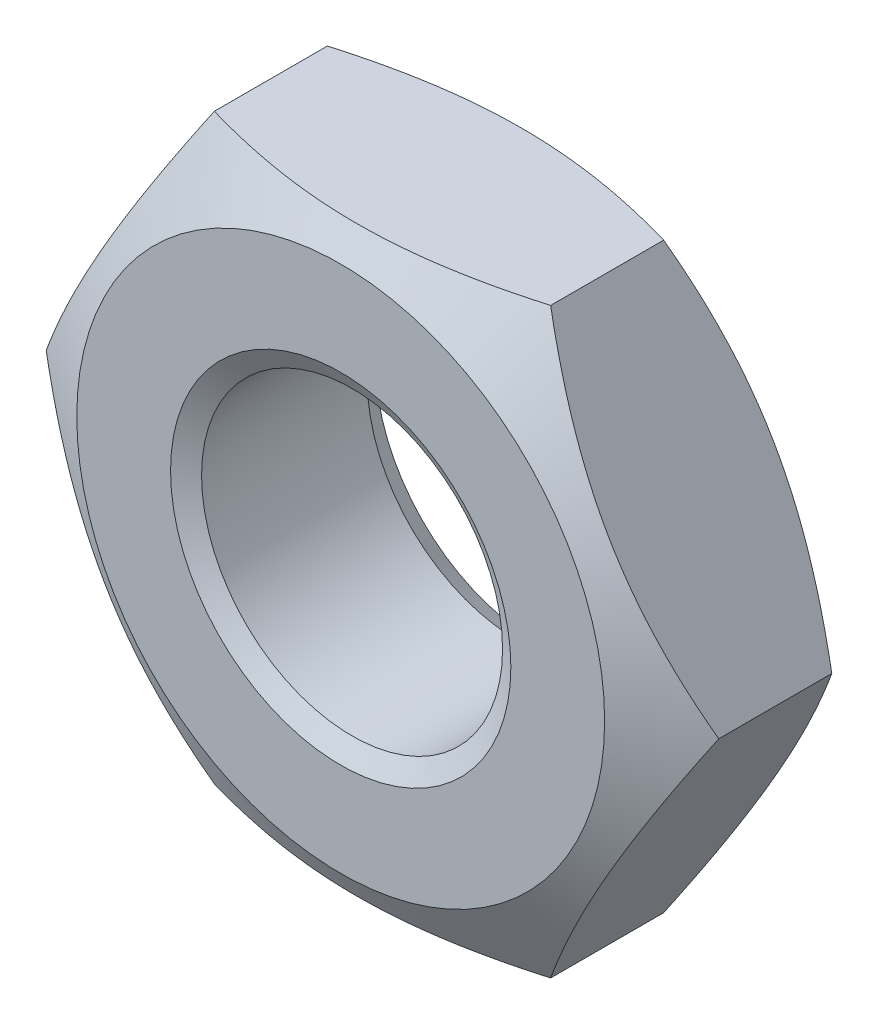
ISO-10303-21;
HEADER;
FILE_DESCRIPTION(('STEP AP214'),'2;1');
FILE_NAME('part.step','',(''),(''),'','','');
FILE_SCHEMA(('AUTOMOTIVE_DESIGN { 1 0 10303 214 1 1 1 1 }'));
ENDSEC;
DATA;
#1=APPLICATION_CONTEXT('core data for automotive mechanical design processes');
#2=APPLICATION_PROTOCOL_DEFINITION('international standard','automotive_design',2000,#1);
#3=PRODUCT_CONTEXT('',#1,'mechanical');
#4=PRODUCT('Part','Part','',(#3));
#5=PRODUCT_RELATED_PRODUCT_CATEGORY('part','',(#4));
#6=PRODUCT_DEFINITION_FORMATION('','',#4);
#7=PRODUCT_DEFINITION_CONTEXT('part definition',#1,'design');
#8=PRODUCT_DEFINITION('design','',#6,#7);
#9=PRODUCT_DEFINITION_SHAPE('','',#8);
#10=(LENGTH_UNIT() NAMED_UNIT(*) SI_UNIT(.MILLI.,.METRE.));
#11=(NAMED_UNIT(*) PLANE_ANGLE_UNIT() SI_UNIT($,.RADIAN.));
#12=(NAMED_UNIT(*) SI_UNIT($,.STERADIAN.) SOLID_ANGLE_UNIT());
#13=UNCERTAINTY_MEASURE_WITH_UNIT(LENGTH_MEASURE(1.E-05),#10,'distance_accuracy_value','');
#14=(GEOMETRIC_REPRESENTATION_CONTEXT(3) GLOBAL_UNCERTAINTY_ASSIGNED_CONTEXT((#13)) GLOBAL_UNIT_ASSIGNED_CONTEXT((#10,
#11,#12)) REPRESENTATION_CONTEXT('',''));
#15=CARTESIAN_POINT('',(0.,0.,0.));
#16=DIRECTION('',(0.,0.,1.));
#17=DIRECTION('',(1.,0.,0.));
#18=AXIS2_PLACEMENT_3D('',#15,#16,#17);
#19=CARTESIAN_POINT('',(-2.3094010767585,-4.,0.));
#20=DIRECTION('',(0.,0.,-1.));
#21=DIRECTION('',(-1.,0.,0.));
#22=AXIS2_PLACEMENT_3D('',#19,#20,#21);
#23=PLANE('',#22);
#24=CARTESIAN_POINT('',(0.,0.,0.));
#25=DIRECTION('',(0.,0.,-1.));
#26=DIRECTION('',(-1.,0.,0.));
#27=AXIS2_PLACEMENT_3D('',#24,#25,#26);
#28=CIRCLE('',#27,3.62499999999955);
#29=CARTESIAN_POINT('',(-3.62499999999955,0.,0.));
#30=VERTEX_POINT('',#29);
#31=EDGE_CURVE('E136',#30,#30,#28,.T.);
#32=ORIENTED_EDGE('',*,*,#31,.F.);
#33=EDGE_LOOP('',(#32));
#34=FACE_BOUND('',#33,.T.);
#35=CARTESIAN_POINT('',(0.,0.,8.79370749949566E-12));
#36=DIRECTION('',(0.,0.,1.));
#37=DIRECTION('',(1.,0.,0.));
#38=AXIS2_PLACEMENT_3D('',#35,#36,#37);
#39=CIRCLE('',#38,2.33699999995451);
#40=CARTESIAN_POINT('',(2.33699999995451,0.,8.79370749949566E-12));
#41=VERTEX_POINT('',#40);
#42=EDGE_CURVE('E20',#41,#41,#39,.F.);
#43=ORIENTED_EDGE('',*,*,#42,.T.);
#44=EDGE_LOOP('',(#43));
#45=FACE_BOUND('',#44,.T.);
#46=ADVANCED_FACE('F17',(#34,#45),#23,.F.);
#47=CARTESIAN_POINT('',(0.,0.,-5.6843418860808E-11));
#48=DIRECTION('',(0.,0.,1.));
#49=DIRECTION('',(1.,0.,0.));
#50=AXIS2_PLACEMENT_3D('',#47,#48,#49);
#51=CONICAL_SURFACE('',#50,2.33699999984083,1.04719755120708);
#52=CARTESIAN_POINT('',(0.,0.,-0.155884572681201));
#53=DIRECTION('',(0.,0.,1.));
#54=DIRECTION('',(1.,0.,0.));
#55=AXIS2_PLACEMENT_3D('',#52,#53,#54);
#56=CIRCLE('',#55,2.067);
#57=CARTESIAN_POINT('',(2.067,0.,-0.155884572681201));
#58=VERTEX_POINT('',#57);
#59=EDGE_CURVE('E71',#58,#58,#56,.F.);
#60=ORIENTED_EDGE('',*,*,#59,.T.);
#61=EDGE_LOOP('',(#60));
#62=FACE_BOUND('',#61,.T.);
#63=ORIENTED_EDGE('',*,*,#42,.F.);
#64=EDGE_LOOP('',(#63));
#65=FACE_BOUND('',#64,.T.);
#66=ADVANCED_FACE('F111',(#62,#65),#51,.F.);
#67=CARTESIAN_POINT('',(0.,0.,-0.577214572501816));
#68=DIRECTION('',(0.,0.,-1.));
#69=DIRECTION('',(-1.,0.,0.));
#70=AXIS2_PLACEMENT_3D('',#67,#68,#69);
#71=CONICAL_SURFACE('',#70,4.62476496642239,1.04719755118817);
#72=CARTESIAN_POINT('',(4.61880215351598,-1.78150007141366E-12,-0.573771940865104));
#73=CARTESIAN_POINT('',(4.51731796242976,-0.175775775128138,-0.515163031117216));
#74=CARTESIAN_POINT('',(4.41495776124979,-0.353068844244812,-0.461861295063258));
#75=CARTESIAN_POINT('',(4.20846506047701,-0.710724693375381,-0.368824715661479));
#76=CARTESIAN_POINT('',(4.10432889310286,-0.891093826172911,-0.329122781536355));
#77=CARTESIAN_POINT('',(3.89734706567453,-1.24959686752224,-0.26732385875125));
#78=CARTESIAN_POINT('',(3.79453324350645,-1.4276756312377,-0.244815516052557));
#79=CARTESIAN_POINT('',(3.58842207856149,-1.78467064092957,-0.217950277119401));
#80=CARTESIAN_POINT('',(3.48512548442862,-1.96358559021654,-0.213571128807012));
#81=CARTESIAN_POINT('',(3.2921268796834,-2.29786897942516,-0.222704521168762));
#82=CARTESIAN_POINT('',(3.20239590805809,-2.45328758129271,-0.23397451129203));
#83=CARTESIAN_POINT('',(3.02351853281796,-2.76311228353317,-0.269686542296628));
#84=CARTESIAN_POINT('',(2.93437274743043,-2.91751731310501,-0.294140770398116));
#85=CARTESIAN_POINT('',(2.75512686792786,-3.22798028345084,-0.355271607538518));
#86=CARTESIAN_POINT('',(2.66504944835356,-3.38399895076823,-0.392207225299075));
#87=CARTESIAN_POINT('',(2.48623772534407,-3.69370994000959,-0.476035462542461));
#88=CARTESIAN_POINT('',(2.39750113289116,-3.84740622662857,-0.522908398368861));
#89=CARTESIAN_POINT('',(2.30940107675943,-3.99999999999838,-0.573771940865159));
#90=B_SPLINE_CURVE_WITH_KNOTS('',3,(#72,#73,#74,#75,#76,#77,#78,#79,#80,#81,#82,#83,#84,#85,#86,
#87,#88,#89),.UNSPECIFIED.,.F.,.F.,(4,2,2,2,2,2,2,2,4),(0.,0.63403202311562,1.26958763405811,
1.88941521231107,2.50848177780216,3.04741556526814,3.58684838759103,4.13824324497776,
4.68855594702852),.UNSPECIFIED.);
#91=CARTESIAN_POINT('',(4.61880215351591,-8.9058291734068E-13,-0.573771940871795));
#92=VERTEX_POINT('',#91);
#93=CARTESIAN_POINT('',(2.30940107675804,-3.99999999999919,-0.573771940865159));
#94=VERTEX_POINT('',#93);
#95=EDGE_CURVE('E62',#92,#94,#90,.T.);
#96=ORIENTED_EDGE('',*,*,#95,.F.);
#97=CARTESIAN_POINT('',(2.30940107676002,3.99999999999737,-0.573771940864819));
#98=CARTESIAN_POINT('',(2.41088526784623,3.82422422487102,-0.515163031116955));
#99=CARTESIAN_POINT('',(2.51324546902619,3.64693115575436,-0.461861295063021));
#100=CARTESIAN_POINT('',(2.71973816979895,3.28927530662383,-0.368824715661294));
#101=CARTESIAN_POINT('',(2.82387433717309,3.10890617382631,-0.329122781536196));
#102=CARTESIAN_POINT('',(3.03085616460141,2.75040313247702,-0.267323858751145));
#103=CARTESIAN_POINT('',(3.13366998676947,2.57232436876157,-0.244815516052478));
#104=CARTESIAN_POINT('',(3.33978115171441,2.21532935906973,-0.217950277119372));
#105=CARTESIAN_POINT('',(3.44307774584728,2.03641440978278,-0.213571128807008));
#106=CARTESIAN_POINT('',(3.63607635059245,1.70213102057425,-0.222704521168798));
#107=CARTESIAN_POINT('',(3.72580732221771,1.54671241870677,-0.233974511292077));
#108=CARTESIAN_POINT('',(3.90468469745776,1.23688771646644,-0.269686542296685));
#109=CARTESIAN_POINT('',(3.99383048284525,1.08248268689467,-0.294140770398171));
#110=CARTESIAN_POINT('',(4.17307636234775,0.772019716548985,-0.355271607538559));
#111=CARTESIAN_POINT('',(4.26315378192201,0.616001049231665,-0.392207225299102));
#112=CARTESIAN_POINT('',(4.44196550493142,0.306290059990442,-0.476035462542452));
#113=CARTESIAN_POINT('',(4.53070209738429,0.152593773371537,-0.52290839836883));
#114=CARTESIAN_POINT('',(4.61880215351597,1.78588084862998E-12,-0.573771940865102));
#115=B_SPLINE_CURVE_WITH_KNOTS('',3,(#97,#98,#99,#100,#101,#102,#103,#104,#105,#106,#107,#108,
#109,#110,#111,#112,#113,#114),.UNSPECIFIED.,.F.,.F.,(4,2,2,2,2,2,2,2,4),(0.,0.634032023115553,
1.26958763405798,1.88941521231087,2.5084817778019,3.04741556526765,3.5868483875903,
4.13824324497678,4.68855594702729),.UNSPECIFIED.);
#116=CARTESIAN_POINT('',(2.30940107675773,3.99999999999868,-0.573771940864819));
#117=VERTEX_POINT('',#116);
#118=EDGE_CURVE('E66',#117,#92,#115,.T.);
#119=ORIENTED_EDGE('',*,*,#118,.F.);
#120=CARTESIAN_POINT('',(-2.30940107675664,4.,-0.573771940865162));
#121=CARTESIAN_POINT('',(-2.1064326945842,4.,-0.515163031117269));
#122=CARTESIAN_POINT('',(-1.90171229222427,4.,-0.461861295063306));
#123=CARTESIAN_POINT('',(-1.48872689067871,4.,-0.368824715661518));
#124=CARTESIAN_POINT('',(-1.2804545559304,4.,-0.329122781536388));
#125=CARTESIAN_POINT('',(-0.866490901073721,4.,-0.267323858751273));
#126=CARTESIAN_POINT('',(-0.660863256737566,4.,-0.244815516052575));
#127=CARTESIAN_POINT('',(-0.248640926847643,4.,-0.217950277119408));
#128=CARTESIAN_POINT('',(-0.0420477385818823,4.,-0.213571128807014));
#129=CARTESIAN_POINT('',(0.343949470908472,4.,-0.222704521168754));
#130=CARTESIAN_POINT('',(0.523411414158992,4.,-0.233974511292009));
#131=CARTESIAN_POINT('',(0.881166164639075,4.,-0.269686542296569));
#132=CARTESIAN_POINT('',(1.05945773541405,4.,-0.294140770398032));
#133=CARTESIAN_POINT('',(1.41794949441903,4.,-0.355271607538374));
#134=CARTESIAN_POINT('',(1.59810433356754,4.,-0.392207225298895));
#135=CARTESIAN_POINT('',(1.95572777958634,4.,-0.476035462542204));
#136=CARTESIAN_POINT('',(2.13320096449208,4.,-0.522908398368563));
#137=CARTESIAN_POINT('',(2.30940107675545,4.,-0.573771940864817));
#138=B_SPLINE_CURVE_WITH_KNOTS('',3,(#120,#121,#122,#123,#124,#125,#126,#127,#128,#129,#130,
#131,#132,#133,#134,#135,#136,#137),.UNSPECIFIED.,.F.,.F.,(4,2,2,2,2,2,2,2,4),(0.,
0.634032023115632,1.26958763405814,1.88941521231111,2.50848177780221,3.04741556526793,
3.58684838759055,4.138243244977,4.68855594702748),.UNSPECIFIED.);
#139=CARTESIAN_POINT('',(-2.30940107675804,3.99999999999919,-0.573771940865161));
#140=VERTEX_POINT('',#139);
#141=EDGE_CURVE('E85',#140,#117,#138,.T.);
#142=ORIENTED_EDGE('',*,*,#141,.F.);
#143=CARTESIAN_POINT('',(-4.61880215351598,1.78496848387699E-12,-0.573771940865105));
#144=CARTESIAN_POINT('',(-4.51731796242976,0.175775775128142,-0.515163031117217));
#145=CARTESIAN_POINT('',(-4.41495776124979,0.353068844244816,-0.461861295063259));
#146=CARTESIAN_POINT('',(-4.20846506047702,0.710724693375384,-0.368824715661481));
#147=CARTESIAN_POINT('',(-4.10432889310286,0.891093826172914,-0.329122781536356));
#148=CARTESIAN_POINT('',(-3.89734706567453,1.24959686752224,-0.267323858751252));
#149=CARTESIAN_POINT('',(-3.79453324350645,1.4276756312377,-0.24481551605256));
#150=CARTESIAN_POINT('',(-3.5884220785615,1.78467064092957,-0.217950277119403));
#151=CARTESIAN_POINT('',(-3.48512548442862,1.96358559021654,-0.213571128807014));
#152=CARTESIAN_POINT('',(-3.2921268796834,2.29786897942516,-0.222704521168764));
#153=CARTESIAN_POINT('',(-3.2023959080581,2.45328758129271,-0.233974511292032));
#154=CARTESIAN_POINT('',(-3.02351853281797,2.76311228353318,-0.26968654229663));
#155=CARTESIAN_POINT('',(-2.93437274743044,2.91751731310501,-0.294140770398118));
#156=CARTESIAN_POINT('',(-2.75512686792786,3.22798028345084,-0.35527160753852));
#157=CARTESIAN_POINT('',(-2.66504944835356,3.38399895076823,-0.392207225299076));
#158=CARTESIAN_POINT('',(-2.48623772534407,3.69370994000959,-0.476035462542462));
#159=CARTESIAN_POINT('',(-2.39750113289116,3.84740622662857,-0.522908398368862));
#160=CARTESIAN_POINT('',(-2.30940107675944,3.99999999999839,-0.57377194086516));
#161=B_SPLINE_CURVE_WITH_KNOTS('',3,(#143,#144,#145,#146,#147,#148,#149,#150,#151,#152,#153,
#154,#155,#156,#157,#158,#159,#160),.UNSPECIFIED.,.F.,.F.,(4,2,2,2,2,2,2,2,4),(0.,
0.63403202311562,1.26958763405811,1.88941521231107,2.50848177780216,3.04741556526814,
3.58684838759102,4.13824324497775,4.68855594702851),.UNSPECIFIED.);
#162=CARTESIAN_POINT('',(-4.6188021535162,-8.9172990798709E-13,-0.573771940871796));
#163=VERTEX_POINT('',#162);
#164=EDGE_CURVE('E114',#163,#140,#161,.T.);
#165=ORIENTED_EDGE('',*,*,#164,.F.);
#166=CARTESIAN_POINT('',(-2.30940107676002,-3.99999999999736,-0.57377194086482));
#167=CARTESIAN_POINT('',(-2.41088526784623,-3.82422422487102,-0.515163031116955));
#168=CARTESIAN_POINT('',(-2.51324546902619,-3.64693115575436,-0.461861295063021));
#169=CARTESIAN_POINT('',(-2.71973816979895,-3.28927530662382,-0.368824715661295));
#170=CARTESIAN_POINT('',(-2.8238743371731,-3.10890617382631,-0.329122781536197));
#171=CARTESIAN_POINT('',(-3.03085616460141,-2.75040313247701,-0.267323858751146));
#172=CARTESIAN_POINT('',(-3.13366998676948,-2.57232436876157,-0.244815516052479));
#173=CARTESIAN_POINT('',(-3.33978115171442,-2.21532935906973,-0.217950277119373));
#174=CARTESIAN_POINT('',(-3.44307774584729,-2.03641440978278,-0.213571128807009));
#175=CARTESIAN_POINT('',(-3.63607635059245,-1.70213102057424,-0.222704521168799));
#176=CARTESIAN_POINT('',(-3.72580732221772,-1.54671241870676,-0.233974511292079));
#177=CARTESIAN_POINT('',(-3.90468469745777,-1.23688771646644,-0.269686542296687));
#178=CARTESIAN_POINT('',(-3.99383048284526,-1.08248268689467,-0.294140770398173));
#179=CARTESIAN_POINT('',(-4.17307636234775,-0.772019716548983,-0.35527160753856));
#180=CARTESIAN_POINT('',(-4.26315378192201,-0.616001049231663,-0.392207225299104));
#181=CARTESIAN_POINT('',(-4.44196550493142,-0.306290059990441,-0.476035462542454));
#182=CARTESIAN_POINT('',(-4.53070209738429,-0.152593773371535,-0.522908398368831));
#183=CARTESIAN_POINT('',(-4.61880215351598,-1.78449874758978E-12,-0.573771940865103));
#184=B_SPLINE_CURVE_WITH_KNOTS('',3,(#166,#167,#168,#169,#170,#171,#172,#173,#174,#175,#176,
#177,#178,#179,#180,#181,#182,#183),.UNSPECIFIED.,.F.,.F.,(4,2,2,2,2,2,2,2,4),(0.,
0.634032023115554,1.26958763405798,1.88941521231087,2.5084817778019,3.04741556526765,
3.58684838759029,4.13824324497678,4.68855594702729),.UNSPECIFIED.);
#185=CARTESIAN_POINT('',(-2.30940107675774,-3.99999999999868,-0.573771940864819));
#186=VERTEX_POINT('',#185);
#187=EDGE_CURVE('E122',#186,#163,#184,.T.);
#188=ORIENTED_EDGE('',*,*,#187,.F.);
#189=CARTESIAN_POINT('',(2.30940107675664,-4.,-0.573771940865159));
#190=CARTESIAN_POINT('',(2.1064326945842,-4.,-0.515163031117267));
#191=CARTESIAN_POINT('',(1.90171229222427,-4.,-0.461861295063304));
#192=CARTESIAN_POINT('',(1.48872689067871,-4.,-0.368824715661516));
#193=CARTESIAN_POINT('',(1.2804545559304,-4.,-0.329122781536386));
#194=CARTESIAN_POINT('',(0.866490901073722,-4.,-0.267323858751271));
#195=CARTESIAN_POINT('',(0.660863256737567,-4.,-0.244815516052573));
#196=CARTESIAN_POINT('',(0.248640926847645,-4.,-0.217950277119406));
#197=CARTESIAN_POINT('',(0.0420477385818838,-4.,-0.213571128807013));
#198=CARTESIAN_POINT('',(-0.343949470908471,-4.,-0.222704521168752));
#199=CARTESIAN_POINT('',(-0.523411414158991,-4.,-0.233974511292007));
#200=CARTESIAN_POINT('',(-0.881166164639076,-4.,-0.269686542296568));
#201=CARTESIAN_POINT('',(-1.05945773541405,-4.,-0.29414077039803));
#202=CARTESIAN_POINT('',(-1.41794949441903,-4.,-0.355271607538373));
#203=CARTESIAN_POINT('',(-1.59810433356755,-4.,-0.392207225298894));
#204=CARTESIAN_POINT('',(-1.95572777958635,-4.,-0.476035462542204));
#205=CARTESIAN_POINT('',(-2.13320096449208,-4.,-0.522908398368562));
#206=CARTESIAN_POINT('',(-2.30940107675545,-4.,-0.573771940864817));
#207=B_SPLINE_CURVE_WITH_KNOTS('',3,(#189,#190,#191,#192,#193,#194,#195,#196,#197,#198,#199,
#200,#201,#202,#203,#204,#205,#206),.UNSPECIFIED.,.F.,.F.,(4,2,2,2,2,2,2,2,4),(0.,
0.634032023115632,1.26958763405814,1.8894152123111,2.50848177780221,3.04741556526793,
3.58684838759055,4.138243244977,4.68855594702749),.UNSPECIFIED.);
#208=EDGE_CURVE('E69',#94,#186,#207,.T.);
#209=ORIENTED_EDGE('',*,*,#208,.F.);
#210=EDGE_LOOP('',(#96,#119,#142,#165,#188,#209));
#211=FACE_BOUND('',#210,.T.);
#212=ORIENTED_EDGE('',*,*,#31,.T.);
#213=EDGE_LOOP('',(#212));
#214=FACE_BOUND('',#213,.T.);
#215=ADVANCED_FACE('F63',(#211,#214),#71,.T.);
#216=CARTESIAN_POINT('',(0.,0.,-2.7));
#217=DIRECTION('',(0.,0.,1.));
#218=DIRECTION('',(1.,0.,0.));
#219=AXIS2_PLACEMENT_3D('',#216,#217,#218);
#220=CYLINDRICAL_SURFACE('',#219,2.067);
#221=CARTESIAN_POINT('',(0.,0.,-2.43000000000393));
#222=DIRECTION('',(0.,0.,-1.));
#223=DIRECTION('',(-1.,0.,0.));
#224=AXIS2_PLACEMENT_3D('',#221,#222,#223);
#225=CIRCLE('',#224,2.06700000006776);
#226=CARTESIAN_POINT('',(-2.06700000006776,0.,-2.43000000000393));
#227=VERTEX_POINT('',#226);
#228=EDGE_CURVE('E185',#227,#227,#225,.T.);
#229=ORIENTED_EDGE('',*,*,#228,.T.);
#230=EDGE_LOOP('',(#229));
#231=FACE_BOUND('',#230,.T.);
#232=ORIENTED_EDGE('',*,*,#59,.F.);
#233=EDGE_LOOP('',(#232));
#234=FACE_BOUND('',#233,.T.);
#235=ADVANCED_FACE('F110',(#231,#234),#220,.F.);
#236=CARTESIAN_POINT('',(2.3094010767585,-4.,-2.7));
#237=DIRECTION('',(0.866025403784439,-0.5,0.));
#238=DIRECTION('',(0.5,0.866025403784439,0.));
#239=AXIS2_PLACEMENT_3D('',#236,#237,#238);
#240=PLANE('',#239);
#241=CARTESIAN_POINT('',(4.61880215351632,-1.19326901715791E-12,-2.12622805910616));
#242=CARTESIAN_POINT('',(4.5173179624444,-0.175775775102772,-2.18483696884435));
#243=CARTESIAN_POINT('',(4.41495776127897,-0.353068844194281,-2.23813870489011));
#244=CARTESIAN_POINT('',(4.20846506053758,-0.710724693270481,-2.33117528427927));
#245=CARTESIAN_POINT('',(4.10432889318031,-0.891093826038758,-2.37087721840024));
#246=CARTESIAN_POINT('',(3.89734706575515,-1.24959686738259,-2.43267614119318));
#247=CARTESIAN_POINT('',(3.79453324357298,-1.42767563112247,-2.45518448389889));
#248=CARTESIAN_POINT('',(3.58842207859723,-1.78467064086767,-2.48204972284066));
#249=CARTESIAN_POINT('',(3.48512548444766,-1.96358559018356,-2.48642887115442));
#250=CARTESIAN_POINT('',(3.29212688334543,-2.29786897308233,-2.47729547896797));
#251=CARTESIAN_POINT('',(3.20239591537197,-2.4532875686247,-2.4660254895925));
#252=CARTESIAN_POINT('',(3.02351854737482,-2.76311225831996,-2.43031346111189));
#253=CARTESIAN_POINT('',(2.93437276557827,-2.91751728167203,-2.40585923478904));
#254=CARTESIAN_POINT('',(2.75512689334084,-3.22798023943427,-2.34472840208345));
#255=CARTESIAN_POINT('',(2.66504947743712,-3.38399890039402,-2.3077927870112));
#256=CARTESIAN_POINT('',(2.48623776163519,-3.69370987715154,-2.22396455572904));
#257=CARTESIAN_POINT('',(2.39750117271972,-3.84740615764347,-2.177091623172));
#258=CARTESIAN_POINT('',(2.30940112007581,-3.99999992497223,-2.12622808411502));
#259=B_SPLINE_CURVE_WITH_KNOTS('',3,(#241,#242,#243,#244,#245,#246,#247,#248,#249,#250,#251,
#252,#253,#254,#255,#256,#257,#258),.UNSPECIFIED.,.F.,.F.,(4,2,2,2,2,2,2,2,4),(0.,
0.634032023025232,1.26958763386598,1.88941521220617,2.50848177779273,3.04741554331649,
3.58684834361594,4.13824317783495,4.68855585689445),.UNSPECIFIED.);
#260=CARTESIAN_POINT('',(4.6188021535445,-5.96700084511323E-13,-2.1262280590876));
#261=VERTEX_POINT('',#260);
#262=CARTESIAN_POINT('',(2.30940109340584,-4.,-2.12622805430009));
#263=VERTEX_POINT('',#262);
#264=EDGE_CURVE('E35',#261,#263,#259,.T.);
#265=ORIENTED_EDGE('',*,*,#264,.F.);
#266=DIRECTION('',(0.,0.,1.));
#267=VECTOR('',#266,1.);
#268=CARTESIAN_POINT('',(4.618802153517,0.,-2.7));
#269=LINE('',#268,#267);
#270=EDGE_CURVE('E73',#92,#261,#269,.F.);
#271=ORIENTED_EDGE('',*,*,#270,.F.);
#272=ORIENTED_EDGE('',*,*,#95,.T.);
#273=DIRECTION('',(0.,0.,1.));
#274=VECTOR('',#273,1.);
#275=CARTESIAN_POINT('',(2.3094010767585,-4.,-2.7));
#276=LINE('',#275,#274);
#277=EDGE_CURVE('E188',#263,#94,#276,.T.);
#278=ORIENTED_EDGE('',*,*,#277,.F.);
#279=EDGE_LOOP('',(#265,#271,#272,#278));
#280=FACE_BOUND('',#279,.T.);
#281=ADVANCED_FACE('F74',(#280),#240,.T.);
#282=CARTESIAN_POINT('',(-2.3094010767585,-4.,-2.7));
#283=DIRECTION('',(0.,-1.,0.));
#284=DIRECTION('',(1.,0.,0.));
#285=AXIS2_PLACEMENT_3D('',#282,#283,#284);
#286=PLANE('',#285);
#287=CARTESIAN_POINT('',(2.30940110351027,-3.99999996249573,-2.12622802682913));
#288=CARTESIAN_POINT('',(2.10643272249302,-3.99999998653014,-2.18483695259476));
#289=CARTESIAN_POINT('',(1.90171231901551,-3.99999999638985,-2.23813869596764));
#290=CARTESIAN_POINT('',(1.48872691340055,-4.00000000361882,-2.33117528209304));
#291=CARTESIAN_POINT('',(1.28045457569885,-4.00000000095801,-2.37087721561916));
#292=CARTESIAN_POINT('',(0.866490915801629,-3.99999999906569,-2.43267613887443));
#293=CARTESIAN_POINT('',(0.660863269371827,-3.99999999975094,-2.45518448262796));
#294=CARTESIAN_POINT('',(0.248640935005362,-4.00000000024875,-2.4820497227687));
#295=CARTESIAN_POINT('',(0.0420477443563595,-4.00000000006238,-2.48642887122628));
#296=CARTESIAN_POINT('',(-0.34394946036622,-3.99999999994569,-2.47729547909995));
#297=CARTESIAN_POINT('',(-0.523411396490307,-3.99999999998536,-2.46602548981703));
#298=CARTESIAN_POINT('',(-0.881166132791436,-4.00000000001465,-2.430313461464));
#299=CARTESIAN_POINT('',(-1.05945769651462,-4.00000000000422,-2.40585923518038));
#300=CARTESIAN_POINT('',(-1.41794944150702,-3.99999999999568,-2.34472840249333));
#301=CARTESIAN_POINT('',(-1.59810427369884,-3.99999999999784,-2.3077927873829));
#302=CARTESIAN_POINT('',(-1.95572770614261,-4.00000000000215,-2.22396455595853));
#303=CARTESIAN_POINT('',(-2.13320088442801,-4.0000000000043,-2.17709162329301));
#304=CARTESIAN_POINT('',(-2.3094009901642,-4.,-2.12622808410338));
#305=B_SPLINE_CURVE_WITH_KNOTS('',3,(#287,#288,#289,#290,#291,#292,#293,#294,#295,#296,#297,
#298,#299,#300,#301,#302,#303,#304),.UNSPECIFIED.,.F.,.F.,(4,2,2,2,2,2,2,2,4),(0.,
0.634032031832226,1.26958765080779,1.88941523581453,2.50848180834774,3.04741557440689,
3.58684837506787,4.13824321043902,4.68855589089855),.UNSPECIFIED.);
#306=CARTESIAN_POINT('',(-2.30940106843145,-4.00000001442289,-2.12622805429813));
#307=VERTEX_POINT('',#306);
#308=EDGE_CURVE('E147',#263,#307,#305,.T.);
#309=ORIENTED_EDGE('',*,*,#308,.F.);
#310=ORIENTED_EDGE('',*,*,#277,.T.);
#311=ORIENTED_EDGE('',*,*,#208,.T.);
#312=DIRECTION('',(0.,0.,1.));
#313=VECTOR('',#312,1.);
#314=CARTESIAN_POINT('',(-2.3094010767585,-4.,-2.7));
#315=LINE('',#314,#313);
#316=EDGE_CURVE('E190',#307,#186,#315,.T.);
#317=ORIENTED_EDGE('',*,*,#316,.F.);
#318=EDGE_LOOP('',(#309,#310,#311,#317));
#319=FACE_BOUND('',#318,.T.);
#320=ADVANCED_FACE('F139',(#319),#286,.T.);
#321=CARTESIAN_POINT('',(-4.61880215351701,0.,-2.7));
#322=DIRECTION('',(-0.866025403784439,-0.5,0.));
#323=DIRECTION('',(0.5,-0.866025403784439,0.));
#324=AXIS2_PLACEMENT_3D('',#321,#322,#323);
#325=PLANE('',#324);
#326=CARTESIAN_POINT('',(-2.3094010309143,-4.00000000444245,-2.12622802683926));
#327=CARTESIAN_POINT('',(-2.41088524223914,-3.82422424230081,-2.18483695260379));
#328=CARTESIAN_POINT('',(-2.51324545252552,-3.64693117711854,-2.23813869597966));
#329=CARTESIAN_POINT('',(-2.71973816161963,-3.28927532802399,-2.33117528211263));
#330=CARTESIAN_POINT('',(-2.82387432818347,-3.10890619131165,-2.37087721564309));
#331=CARTESIAN_POINT('',(-3.03085615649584,-2.75040314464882,-2.43267613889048));
#332=CARTESIAN_POINT('',(-3.13366998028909,-2.57232437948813,-2.45518448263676));
#333=CARTESIAN_POINT('',(-3.33978114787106,-2.21532936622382,-2.48204972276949));
#334=CARTESIAN_POINT('',(-3.44307774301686,-2.0364144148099,-2.48642887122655));
#335=CARTESIAN_POINT('',(-3.63607634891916,-1.70213102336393,-2.47729547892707));
#336=CARTESIAN_POINT('',(-3.72580732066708,-1.5467124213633,-2.46602548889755));
#337=CARTESIAN_POINT('',(-3.90468469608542,-1.23688771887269,-2.43031345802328));
#338=CARTESIAN_POINT('',(-3.99383048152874,-1.08248268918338,-2.40585922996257));
#339=CARTESIAN_POINT('',(-4.17307636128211,-0.772019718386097,-2.34472839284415));
#340=CARTESIAN_POINT('',(-4.26315378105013,-0.6160010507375,-2.30779277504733));
#341=CARTESIAN_POINT('',(-4.44196550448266,-0.306290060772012,-2.22396453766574));
#342=CARTESIAN_POINT('',(-4.53070209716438,-0.152593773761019,-2.17709160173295));
#343=CARTESIAN_POINT('',(-4.61880215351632,-1.19228974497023E-12,-2.12622805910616));
#344=B_SPLINE_CURVE_WITH_KNOTS('',3,(#326,#327,#328,#329,#330,#331,#332,#333,#334,#335,#336,
#337,#338,#339,#340,#341,#342,#343),.UNSPECIFIED.,.F.,.F.,(4,2,2,2,2,2,2,2,4),(0.,
0.634032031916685,1.26958765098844,1.88941523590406,2.5084818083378,3.04741559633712,
3.58684841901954,4.13824327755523,4.68855598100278),.UNSPECIFIED.);
#345=CARTESIAN_POINT('',(-4.61880215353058,5.97993290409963E-13,-2.1262280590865));
#346=VERTEX_POINT('',#345);
#347=EDGE_CURVE('E153',#307,#346,#344,.T.);
#348=ORIENTED_EDGE('',*,*,#347,.F.);
#349=ORIENTED_EDGE('',*,*,#316,.T.);
#350=ORIENTED_EDGE('',*,*,#187,.T.);
#351=DIRECTION('',(0.,0.,1.));
#352=VECTOR('',#351,1.);
#353=CARTESIAN_POINT('',(-4.61880215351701,0.,-2.7));
#354=LINE('',#353,#352);
#355=EDGE_CURVE('E193',#346,#163,#354,.T.);
#356=ORIENTED_EDGE('',*,*,#355,.F.);
#357=EDGE_LOOP('',(#348,#349,#350,#356));
#358=FACE_BOUND('',#357,.T.);
#359=ADVANCED_FACE('F143',(#358),#325,.T.);
#360=CARTESIAN_POINT('',(-2.3094010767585,4.,-2.7));
#361=DIRECTION('',(-0.866025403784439,0.5,0.));
#362=DIRECTION('',(-0.5,-0.866025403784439,0.));
#363=AXIS2_PLACEMENT_3D('',#360,#361,#362);
#364=PLANE('',#363);
#365=CARTESIAN_POINT('',(-4.61880215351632,1.19539900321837E-12,-2.12622805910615));
#366=CARTESIAN_POINT('',(-4.5173179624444,0.175775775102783,-2.18483696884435));
#367=CARTESIAN_POINT('',(-4.41495776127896,0.3530688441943,-2.23813870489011));
#368=CARTESIAN_POINT('',(-4.20846506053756,0.710724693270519,-2.33117528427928));
#369=CARTESIAN_POINT('',(-4.10432889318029,0.891093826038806,-2.37087721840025));
#370=CARTESIAN_POINT('',(-3.89734706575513,1.24959686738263,-2.43267614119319));
#371=CARTESIAN_POINT('',(-3.79453324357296,1.42767563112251,-2.45518448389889));
#372=CARTESIAN_POINT('',(-3.58842207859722,1.78467064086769,-2.48204972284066));
#373=CARTESIAN_POINT('',(-3.48512548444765,1.96358559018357,-2.48642887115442));
#374=CARTESIAN_POINT('',(-3.2921268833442,2.29786897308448,-2.47729547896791));
#375=CARTESIAN_POINT('',(-3.2023959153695,2.45328756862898,-2.46602548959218));
#376=CARTESIAN_POINT('',(-3.0235185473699,2.76311225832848,-2.43031346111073));
#377=CARTESIAN_POINT('',(-2.93437276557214,2.91751728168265,-2.40585923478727));
#378=CARTESIAN_POINT('',(-2.75512689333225,3.22798023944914,-2.34472840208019));
#379=CARTESIAN_POINT('',(-2.6650494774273,3.38399890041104,-2.30779278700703));
#380=CARTESIAN_POINT('',(-2.48623776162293,3.69370987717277,-2.22396455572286));
#381=CARTESIAN_POINT('',(-2.39750117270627,3.84740615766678,-2.17709162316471));
#382=CARTESIAN_POINT('',(-2.30940112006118,3.99999992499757,-2.12622808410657));
#383=B_SPLINE_CURVE_WITH_KNOTS('',3,(#365,#366,#367,#368,#369,#370,#371,#372,#373,#374,#375,
#376,#377,#378,#379,#380,#381,#382),.UNSPECIFIED.,.F.,.F.,(4,2,2,2,2,2,2,2,4),(0.,
0.634032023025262,1.26958763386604,1.88941521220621,2.50848177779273,3.04741554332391,
3.5868483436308,4.13824317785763,4.6885558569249),.UNSPECIFIED.);
#384=CARTESIAN_POINT('',(-2.30940109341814,4.,-2.12622805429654));
#385=VERTEX_POINT('',#384);
#386=EDGE_CURVE('E210',#346,#385,#383,.T.);
#387=ORIENTED_EDGE('',*,*,#386,.F.);
#388=ORIENTED_EDGE('',*,*,#355,.T.);
#389=ORIENTED_EDGE('',*,*,#164,.T.);
#390=DIRECTION('',(0.,0.,1.));
#391=VECTOR('',#390,1.);
#392=CARTESIAN_POINT('',(-2.3094010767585,4.,-2.7));
#393=LINE('',#392,#391);
#394=EDGE_CURVE('E82',#385,#140,#393,.T.);
#395=ORIENTED_EDGE('',*,*,#394,.F.);
#396=EDGE_LOOP('',(#387,#388,#389,#395));
#397=FACE_BOUND('',#396,.T.);
#398=ADVANCED_FACE('F201',(#397),#364,.T.);
#399=CARTESIAN_POINT('',(2.3094010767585,4.,-2.7));
#400=DIRECTION('',(0.,1.,0.));
#401=DIRECTION('',(0.,0.,1.));
#402=AXIS2_PLACEMENT_3D('',#399,#400,#401);
#403=PLANE('',#402);
#404=CARTESIAN_POINT('',(-2.30940110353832,3.99999996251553,-2.12622802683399));
#405=CARTESIAN_POINT('',(-2.10643272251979,3.99999998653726,-2.18483695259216));
#406=CARTESIAN_POINT('',(-1.9017123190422,3.99999999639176,-2.23813869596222));
#407=CARTESIAN_POINT('',(-1.48872691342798,4.00000000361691,-2.33117528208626));
#408=CARTESIAN_POINT('',(-1.2804545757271,4.00000000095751,-2.37087721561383));
#409=CARTESIAN_POINT('',(-0.866490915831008,3.99999999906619,-2.43267613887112));
#410=CARTESIAN_POINT('',(-0.660863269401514,3.99999999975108,-2.45518448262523));
#411=CARTESIAN_POINT('',(-0.248640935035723,4.00000000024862,-2.48204972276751));
#412=CARTESIAN_POINT('',(-0.0420477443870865,4.00000000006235,-2.48642887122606));
#413=CARTESIAN_POINT('',(0.343949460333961,3.99999999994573,-2.47729547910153));
#414=CARTESIAN_POINT('',(0.523411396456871,3.99999999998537,-2.46602548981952));
#415=CARTESIAN_POINT('',(0.881166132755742,4.00000000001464,-2.43031346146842));
#416=CARTESIAN_POINT('',(1.05945769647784,4.00000000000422,-2.4058592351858));
#417=CARTESIAN_POINT('',(1.41794944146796,3.99999999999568,-2.34472840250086));
#418=CARTESIAN_POINT('',(1.59810427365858,3.99999999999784,-2.30779278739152));
#419=CARTESIAN_POINT('',(1.95572770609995,4.00000000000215,-2.22396455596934));
#420=CARTESIAN_POINT('',(2.13320088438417,4.0000000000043,-2.17709162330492));
#421=CARTESIAN_POINT('',(2.30940099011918,4.,-2.12622808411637));
#422=B_SPLINE_CURVE_WITH_KNOTS('',3,(#404,#405,#406,#407,#408,#409,#410,#411,#412,#413,#414,
#415,#416,#417,#418,#419,#420,#421),.UNSPECIFIED.,.F.,.F.,(4,2,2,2,2,2,2,2,4),(0.,
0.634032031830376,1.26958765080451,1.88941523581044,2.50848180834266,3.04741557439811,
3.58684837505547,4.13824321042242,4.68855589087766),.UNSPECIFIED.);
#423=CARTESIAN_POINT('',(2.30940106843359,4.00000001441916,-2.12622805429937));
#424=VERTEX_POINT('',#423);
#425=EDGE_CURVE('E168',#385,#424,#422,.T.);
#426=ORIENTED_EDGE('',*,*,#425,.F.);
#427=ORIENTED_EDGE('',*,*,#394,.T.);
#428=ORIENTED_EDGE('',*,*,#141,.T.);
#429=DIRECTION('',(0.,0.,1.));
#430=VECTOR('',#429,1.);
#431=CARTESIAN_POINT('',(2.3094010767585,4.,-2.7));
#432=LINE('',#431,#430);
#433=EDGE_CURVE('E78',#424,#117,#432,.T.);
#434=ORIENTED_EDGE('',*,*,#433,.F.);
#435=EDGE_LOOP('',(#426,#427,#428,#434));
#436=FACE_BOUND('',#435,.T.);
#437=ADVANCED_FACE('F205',(#436),#403,.T.);
#438=CARTESIAN_POINT('',(4.618802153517,0.,-2.7));
#439=DIRECTION('',(0.866025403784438,0.5,0.));
#440=DIRECTION('',(-0.5,0.866025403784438,0.));
#441=AXIS2_PLACEMENT_3D('',#438,#439,#440);
#442=PLANE('',#441);
#443=CARTESIAN_POINT('',(2.30940103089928,4.00000000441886,-2.12622802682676));
#444=CARTESIAN_POINT('',(2.41088524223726,3.82422424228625,-2.18483695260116));
#445=CARTESIAN_POINT('',(2.51324545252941,3.64693117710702,-2.23813869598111));
#446=CARTESIAN_POINT('',(2.71973816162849,3.28927532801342,-2.33117528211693));
#447=CARTESIAN_POINT('',(2.82387432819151,3.10890619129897,-2.37087721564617));
#448=CARTESIAN_POINT('',(3.03085615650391,2.7504031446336,-2.43267613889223));
#449=CARTESIAN_POINT('',(3.13366998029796,2.57232437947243,-2.45518448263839));
#450=CARTESIAN_POINT('',(3.33978114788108,2.21532936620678,-2.48204972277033));
#451=CARTESIAN_POINT('',(3.44307774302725,2.03641441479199,-2.48642887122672));
#452=CARTESIAN_POINT('',(3.63607634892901,1.70213102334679,-2.47729547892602));
#453=CARTESIAN_POINT('',(3.72580732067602,1.54671242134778,-2.46602548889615));
#454=CARTESIAN_POINT('',(3.90468469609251,1.23688771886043,-2.43031345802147));
#455=CARTESIAN_POINT('',(3.99383048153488,1.08248268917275,-2.40585922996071));
#456=CARTESIAN_POINT('',(4.17307636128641,0.77201971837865,-2.34472839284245));
#457=CARTESIAN_POINT('',(4.26315378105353,0.616001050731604,-2.30779277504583));
#458=CARTESIAN_POINT('',(4.44196550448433,0.306290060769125,-2.22396453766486));
#459=CARTESIAN_POINT('',(4.53070209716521,0.152593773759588,-2.17709160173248));
#460=CARTESIAN_POINT('',(4.61880215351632,1.19348474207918E-12,-2.12622805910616));
#461=B_SPLINE_CURVE_WITH_KNOTS('',3,(#443,#444,#445,#446,#447,#448,#449,#450,#451,#452,#453,
#454,#455,#456,#457,#458,#459,#460),.UNSPECIFIED.,.F.,.F.,(4,2,2,2,2,2,2,2,4),(0.,
0.634032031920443,1.26958765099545,1.88941523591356,2.50848180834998,3.04741559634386,
3.5868484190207,4.13824327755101,4.68855598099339),.UNSPECIFIED.);
#462=EDGE_CURVE('E176',#424,#261,#461,.T.);
#463=ORIENTED_EDGE('',*,*,#462,.F.);
#464=ORIENTED_EDGE('',*,*,#433,.T.);
#465=ORIENTED_EDGE('',*,*,#118,.T.);
#466=ORIENTED_EDGE('',*,*,#270,.T.);
#467=EDGE_LOOP('',(#463,#464,#465,#466));
#468=FACE_BOUND('',#467,.T.);
#469=ADVANCED_FACE('F81',(#468),#442,.T.);
#470=CARTESIAN_POINT('',(0.,0.,-2.69999999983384));
#471=DIRECTION('',(0.,0.,-1.));
#472=DIRECTION('',(-1.,0.,0.));
#473=AXIS2_PLACEMENT_3D('',#470,#471,#472);
#474=CONICAL_SURFACE('',#473,2.22288457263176,0.523598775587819);
#475=ORIENTED_EDGE('',*,*,#228,.F.);
#476=EDGE_LOOP('',(#475));
#477=FACE_BOUND('',#476,.T.);
#478=CARTESIAN_POINT('',(0.,0.,-2.70000000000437));
#479=DIRECTION('',(0.,0.,-1.));
#480=DIRECTION('',(-1.,0.,0.));
#481=AXIS2_PLACEMENT_3D('',#478,#479,#480);
#482=CIRCLE('',#481,2.22288457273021);
#483=CARTESIAN_POINT('',(-2.22288457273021,0.,-2.70000000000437));
#484=VERTEX_POINT('',#483);
#485=EDGE_CURVE('E26',#484,#484,#482,.F.);
#486=ORIENTED_EDGE('',*,*,#485,.F.);
#487=EDGE_LOOP('',(#486));
#488=FACE_BOUND('',#487,.T.);
#489=ADVANCED_FACE('F163',(#477,#488),#474,.F.);
#490=CARTESIAN_POINT('',(0.,0.,-2.12278542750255));
#491=DIRECTION('',(0.,0.,1.));
#492=DIRECTION('',(1.,0.,0.));
#493=AXIS2_PLACEMENT_3D('',#490,#491,#492);
#494=CONICAL_SURFACE('',#493,4.62476496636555,1.0471975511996);
#495=ORIENTED_EDGE('',*,*,#347,.T.);
#496=ORIENTED_EDGE('',*,*,#386,.T.);
#497=ORIENTED_EDGE('',*,*,#425,.T.);
#498=ORIENTED_EDGE('',*,*,#462,.T.);
#499=ORIENTED_EDGE('',*,*,#264,.T.);
#500=ORIENTED_EDGE('',*,*,#308,.T.);
#501=EDGE_LOOP('',(#495,#496,#497,#498,#499,#500));
#502=FACE_BOUND('',#501,.T.);
#503=CARTESIAN_POINT('',(0.,0.,-2.6999999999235));
#504=DIRECTION('',(0.,0.,1.));
#505=DIRECTION('',(1.,0.,0.));
#506=AXIS2_PLACEMENT_3D('',#503,#504,#505);
#507=CIRCLE('',#506,3.62500000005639);
#508=CARTESIAN_POINT('',(3.62500000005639,0.,-2.6999999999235));
#509=VERTEX_POINT('',#508);
#510=EDGE_CURVE('E11',#509,#509,#507,.F.);
#511=ORIENTED_EDGE('',*,*,#510,.F.);
#512=EDGE_LOOP('',(#511));
#513=FACE_BOUND('',#512,.T.);
#514=ADVANCED_FACE('F158',(#502,#513),#494,.T.);
#515=CARTESIAN_POINT('',(-2.3094010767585,-4.,-2.7));
#516=DIRECTION('',(0.,0.,-1.));
#517=DIRECTION('',(-1.,0.,0.));
#518=AXIS2_PLACEMENT_3D('',#515,#516,#517);
#519=PLANE('',#518);
#520=ORIENTED_EDGE('',*,*,#510,.T.);
#521=EDGE_LOOP('',(#520));
#522=FACE_BOUND('',#521,.T.);
#523=ORIENTED_EDGE('',*,*,#485,.T.);
#524=EDGE_LOOP('',(#523));
#525=FACE_BOUND('',#524,.T.);
#526=ADVANCED_FACE('F162',(#522,#525),#519,.T.);
#527=CLOSED_SHELL('',(#46,#66,#215,#235,#281,#320,#359,#398,#437,#469,#489,#514,#526));
#528=MANIFOLD_SOLID_BREP('B1',#527);
#529=ADVANCED_BREP_SHAPE_REPRESENTATION('',(#18,#528),#14);
#530=SHAPE_DEFINITION_REPRESENTATION(#9,#529);
ENDSEC;
END-ISO-10303-21;
